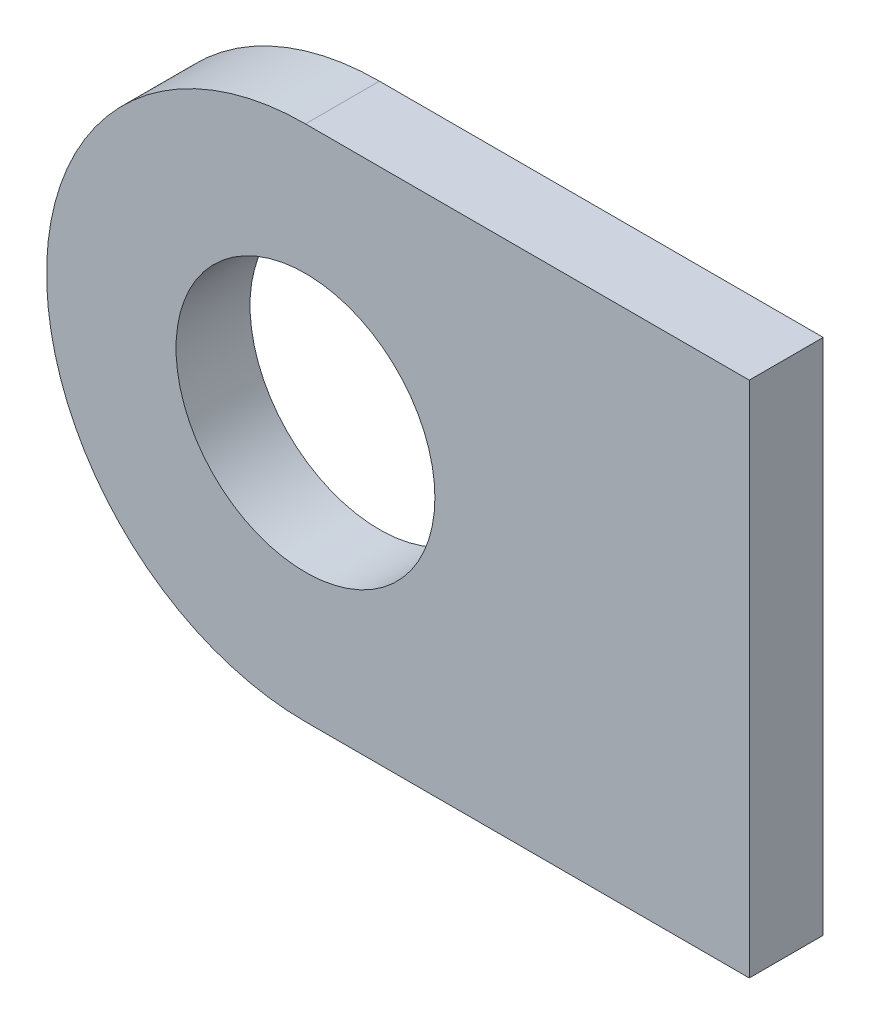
from build123d import *

# Parameters (mm, degrees)
SKETCH1_R           = 17.5
BOSS_EXTRUDE1_DEPTH = 10


with BuildPart() as part:
    # Sketch1 → Boss-Extrude1 (new body)
    with BuildSketch(Plane.XY):
        with BuildLine():
            Line((0, 0), (-60, 0))
            ThreePointArc((-60, 0), (-95, -35), (-60, -70))
            Line((-60, -70), (0, -70))
            Line((0, -70), (0, 0))
        make_face()
        with Locations((-60, -35)):
            Circle(SKETCH1_R, mode=Mode.SUBTRACT)
    extrude(amount=BOSS_EXTRUDE1_DEPTH)


solid = part.part
